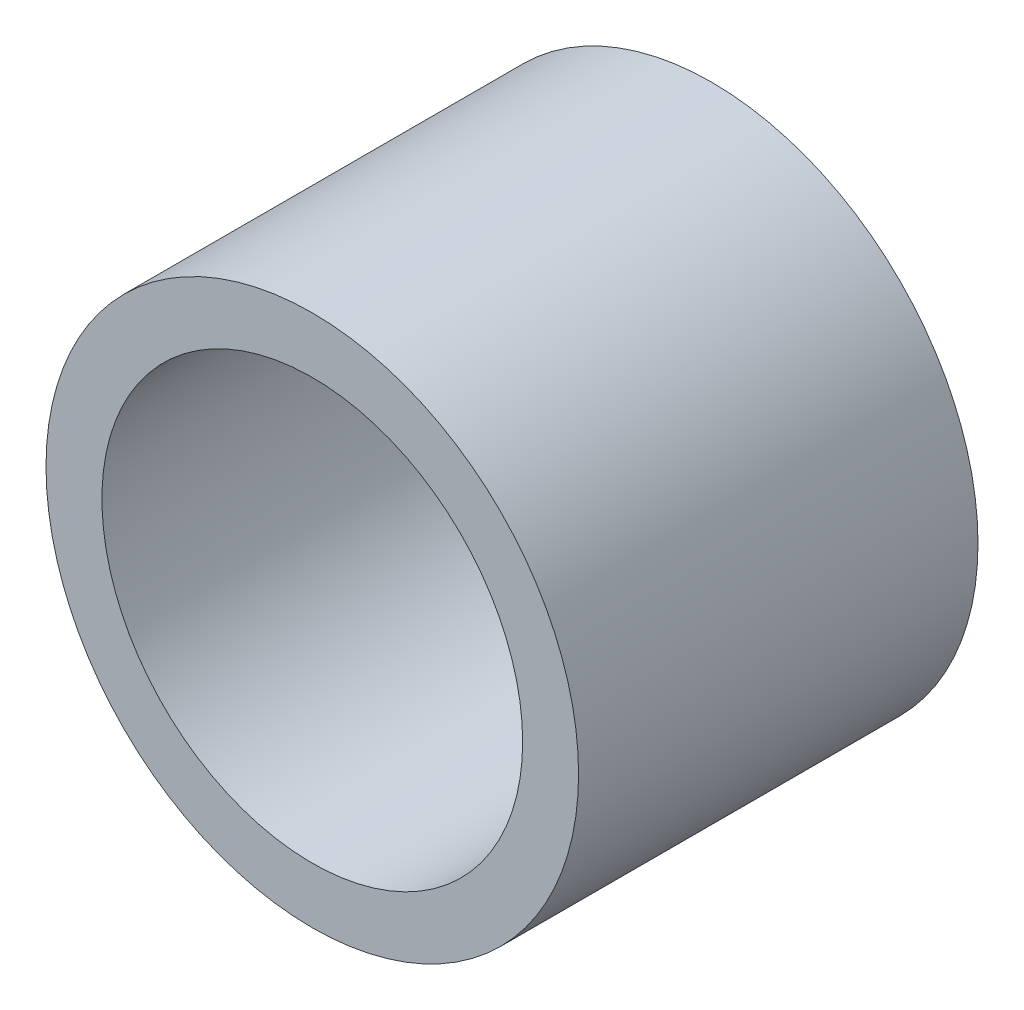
ISO-10303-21;
HEADER;
FILE_DESCRIPTION(('STEP AP214'),'2;1');
FILE_NAME('part.step','',(''),(''),'','','');
FILE_SCHEMA(('AUTOMOTIVE_DESIGN { 1 0 10303 214 1 1 1 1 }'));
ENDSEC;
DATA;
#1=APPLICATION_CONTEXT('core data for automotive mechanical design processes');
#2=APPLICATION_PROTOCOL_DEFINITION('international standard','automotive_design',2000,#1);
#3=PRODUCT_CONTEXT('',#1,'mechanical');
#4=PRODUCT('Part','Part','',(#3));
#5=PRODUCT_RELATED_PRODUCT_CATEGORY('part','',(#4));
#6=PRODUCT_DEFINITION_FORMATION('','',#4);
#7=PRODUCT_DEFINITION_CONTEXT('part definition',#1,'design');
#8=PRODUCT_DEFINITION('design','',#6,#7);
#9=PRODUCT_DEFINITION_SHAPE('','',#8);
#10=(LENGTH_UNIT() NAMED_UNIT(*) SI_UNIT(.MILLI.,.METRE.));
#11=(NAMED_UNIT(*) PLANE_ANGLE_UNIT() SI_UNIT($,.RADIAN.));
#12=(NAMED_UNIT(*) SI_UNIT($,.STERADIAN.) SOLID_ANGLE_UNIT());
#13=UNCERTAINTY_MEASURE_WITH_UNIT(LENGTH_MEASURE(1.E-05),#10,'distance_accuracy_value','');
#14=(GEOMETRIC_REPRESENTATION_CONTEXT(3) GLOBAL_UNCERTAINTY_ASSIGNED_CONTEXT((#13)) GLOBAL_UNIT_ASSIGNED_CONTEXT((#10,
#11,#12)) REPRESENTATION_CONTEXT('',''));
#15=CARTESIAN_POINT('',(0.,0.,0.));
#16=DIRECTION('',(0.,0.,1.));
#17=DIRECTION('',(1.,0.,0.));
#18=AXIS2_PLACEMENT_3D('',#15,#16,#17);
#19=CARTESIAN_POINT('',(-7.62,12.7,30.988));
#20=DIRECTION('',(0.,0.,-1.));
#21=DIRECTION('',(-1.,0.,0.));
#22=AXIS2_PLACEMENT_3D('',#19,#20,#21);
#23=CYLINDRICAL_SURFACE('',#22,2.413);
#24=CARTESIAN_POINT('',(-7.62,12.7,7.112));
#25=DIRECTION('',(0.,0.,1.));
#26=DIRECTION('',(1.,0.,0.));
#27=AXIS2_PLACEMENT_3D('',#24,#25,#26);
#28=CIRCLE('',#27,2.413);
#29=CARTESIAN_POINT('',(-5.207,12.7,7.112));
#30=VERTEX_POINT('',#29);
#31=EDGE_CURVE('E41',#30,#30,#28,.T.);
#32=ORIENTED_EDGE('',*,*,#31,.T.);
#33=EDGE_LOOP('',(#32));
#34=FACE_BOUND('',#33,.T.);
#35=CARTESIAN_POINT('',(-7.62,12.7,1.524));
#36=DIRECTION('',(0.,0.,-1.));
#37=DIRECTION('',(-1.,0.,0.));
#38=AXIS2_PLACEMENT_3D('',#35,#36,#37);
#39=CIRCLE('',#38,2.413);
#40=CARTESIAN_POINT('',(-10.033,12.7,1.524));
#41=VERTEX_POINT('',#40);
#42=EDGE_CURVE('E47',#41,#41,#39,.F.);
#43=ORIENTED_EDGE('',*,*,#42,.F.);
#44=EDGE_LOOP('',(#43));
#45=FACE_BOUND('',#44,.T.);
#46=ADVANCED_FACE('F24',(#34,#45),#23,.F.);
#47=CARTESIAN_POINT('',(0.,0.,38.1));
#48=DIRECTION('',(0.,0.,-1.));
#49=DIRECTION('',(-1.,0.,0.));
#50=AXIS2_PLACEMENT_3D('',#47,#48,#49);
#51=CYLINDRICAL_SURFACE('',#50,25.4);
#52=CARTESIAN_POINT('',(0.,0.,38.1));
#53=DIRECTION('',(0.,0.,1.));
#54=DIRECTION('',(1.,0.,0.));
#55=AXIS2_PLACEMENT_3D('',#52,#53,#54);
#56=CIRCLE('',#55,25.4);
#57=CARTESIAN_POINT('',(-25.4,0.,38.1));
#58=VERTEX_POINT('',#57);
#59=EDGE_CURVE('E10',#58,#58,#56,.T.);
#60=CARTESIAN_POINT('',(0.,0.,0.));
#61=DIRECTION('',(0.,0.,1.));
#62=DIRECTION('',(1.,0.,0.));
#63=AXIS2_PLACEMENT_3D('',#60,#61,#62);
#64=CIRCLE('',#63,25.4);
#65=CARTESIAN_POINT('',(-25.4,0.,0.));
#66=VERTEX_POINT('',#65);
#67=EDGE_CURVE('E32',#66,#66,#64,.T.);
#68=CARTESIAN_POINT('',(-25.4,0.,38.1));
#69=CARTESIAN_POINT('',(-25.4,0.,37.703125));
#70=CARTESIAN_POINT('',(-25.4,0.,37.30625));
#71=CARTESIAN_POINT('',(-25.4,0.,36.5125));
#72=CARTESIAN_POINT('',(-25.4,0.,36.115625));
#73=CARTESIAN_POINT('',(-25.4,0.,35.321875));
#74=CARTESIAN_POINT('',(-25.4,0.,34.925));
#75=CARTESIAN_POINT('',(-25.4,0.,34.13125));
#76=CARTESIAN_POINT('',(-25.4,0.,33.734375));
#77=CARTESIAN_POINT('',(-25.4,0.,32.940625));
#78=CARTESIAN_POINT('',(-25.4,0.,32.54375));
#79=CARTESIAN_POINT('',(-25.4,0.,31.75));
#80=CARTESIAN_POINT('',(-25.4,0.,31.353125));
#81=CARTESIAN_POINT('',(-25.4,0.,30.559375));
#82=CARTESIAN_POINT('',(-25.4,0.,30.1625));
#83=CARTESIAN_POINT('',(-25.4,0.,29.36875));
#84=CARTESIAN_POINT('',(-25.4,0.,28.971875));
#85=CARTESIAN_POINT('',(-25.4,0.,28.178125));
#86=CARTESIAN_POINT('',(-25.4,0.,27.78125));
#87=CARTESIAN_POINT('',(-25.4,0.,26.9875));
#88=CARTESIAN_POINT('',(-25.4,0.,26.590625));
#89=CARTESIAN_POINT('',(-25.4,0.,25.796875));
#90=CARTESIAN_POINT('',(-25.4,0.,25.4));
#91=CARTESIAN_POINT('',(-25.4,0.,24.60625));
#92=CARTESIAN_POINT('',(-25.4,0.,24.209375));
#93=CARTESIAN_POINT('',(-25.4,0.,23.415625));
#94=CARTESIAN_POINT('',(-25.4,0.,23.01875));
#95=CARTESIAN_POINT('',(-25.4,0.,22.225));
#96=CARTESIAN_POINT('',(-25.4,0.,21.828125));
#97=CARTESIAN_POINT('',(-25.4,0.,21.034375));
#98=CARTESIAN_POINT('',(-25.4,0.,20.6375));
#99=CARTESIAN_POINT('',(-25.4,0.,19.84375));
#100=CARTESIAN_POINT('',(-25.4,0.,19.446875));
#101=CARTESIAN_POINT('',(-25.4,0.,18.653125));
#102=CARTESIAN_POINT('',(-25.4,0.,18.25625));
#103=CARTESIAN_POINT('',(-25.4,0.,17.4625));
#104=CARTESIAN_POINT('',(-25.4,0.,17.065625));
#105=CARTESIAN_POINT('',(-25.4,0.,16.271875));
#106=CARTESIAN_POINT('',(-25.4,0.,15.875));
#107=CARTESIAN_POINT('',(-25.4,0.,15.08125));
#108=CARTESIAN_POINT('',(-25.4,0.,14.684375));
#109=CARTESIAN_POINT('',(-25.4,0.,13.890625));
#110=CARTESIAN_POINT('',(-25.4,0.,13.49375));
#111=CARTESIAN_POINT('',(-25.4,0.,12.7));
#112=CARTESIAN_POINT('',(-25.4,0.,12.303125));
#113=CARTESIAN_POINT('',(-25.4,0.,11.509375));
#114=CARTESIAN_POINT('',(-25.4,0.,11.1125));
#115=CARTESIAN_POINT('',(-25.4,0.,10.31875));
#116=CARTESIAN_POINT('',(-25.4,0.,9.921875));
#117=CARTESIAN_POINT('',(-25.4,0.,9.128125));
#118=CARTESIAN_POINT('',(-25.4,0.,8.73125));
#119=CARTESIAN_POINT('',(-25.4,0.,7.9375));
#120=CARTESIAN_POINT('',(-25.4,0.,7.540625));
#121=CARTESIAN_POINT('',(-25.4,0.,6.746875));
#122=CARTESIAN_POINT('',(-25.4,0.,6.35));
#123=CARTESIAN_POINT('',(-25.4,0.,5.55625));
#124=CARTESIAN_POINT('',(-25.4,0.,5.159375));
#125=CARTESIAN_POINT('',(-25.4,0.,4.365625));
#126=CARTESIAN_POINT('',(-25.4,0.,3.96875));
#127=CARTESIAN_POINT('',(-25.4,0.,3.175));
#128=CARTESIAN_POINT('',(-25.4,0.,2.778125));
#129=CARTESIAN_POINT('',(-25.4,0.,1.984375));
#130=CARTESIAN_POINT('',(-25.4,0.,1.5875));
#131=CARTESIAN_POINT('',(-25.4,0.,0.79375));
#132=CARTESIAN_POINT('',(-25.4,0.,0.396875));
#133=CARTESIAN_POINT('',(-25.4,0.,0.));
#134=B_SPLINE_CURVE_WITH_KNOTS('',3,(#68,#69,#70,#71,#72,#73,#74,#75,#76,#77,#78,#79,#80,#81,
#82,#83,#84,#85,#86,#87,#88,#89,#90,#91,#92,#93,#94,#95,#96,#97,#98,#99,#100,#101,#102,#103,
#104,#105,#106,#107,#108,#109,#110,#111,#112,#113,#114,#115,#116,#117,#118,#119,#120,#121,#122,
#123,#124,#125,#126,#127,#128,#129,#130,#131,#132,#133),.UNSPECIFIED.,.F.,.F.,(4,2,2,2,2,2,2,2,
2,2,2,2,2,2,2,2,2,2,2,2,2,2,2,2,2,2,2,2,2,2,2,2,4),(0.,1.19062499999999,2.38124999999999,
3.571875,4.7625,5.953125,7.14375,8.33437499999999,9.525,10.715625,11.90625,13.096875,14.2875,
15.478125,16.66875,17.859375,19.05,20.240625,21.43125,22.621875,23.8125,25.003125,26.19375,
27.384375,28.575,29.765625,30.95625,32.146875,33.3375,34.528125,35.71875,36.909375,38.1),.UNSPECIFIED.);
#135=EDGE_CURVE('BSEAM26',#58,#66,#134,.T.);
#136=ORIENTED_EDGE('',*,*,#59,.F.);
#137=ORIENTED_EDGE('',*,*,#67,.T.);
#138=ORIENTED_EDGE('',*,*,#135,.T.);
#139=ORIENTED_EDGE('',*,*,#135,.F.);
#140=EDGE_LOOP('',(#136,#138,#137,#139));
#141=FACE_BOUND('',#140,.T.);
#142=ADVANCED_FACE('F26',(#141),#51,.T.);
#143=CARTESIAN_POINT('',(0.,0.,38.1));
#144=DIRECTION('',(0.,0.,1.));
#145=DIRECTION('',(1.,0.,0.));
#146=AXIS2_PLACEMENT_3D('',#143,#144,#145);
#147=PLANE('',#146);
#148=CARTESIAN_POINT('',(0.,0.,38.1));
#149=DIRECTION('',(0.,0.,1.));
#150=DIRECTION('',(1.,0.,0.));
#151=AXIS2_PLACEMENT_3D('',#148,#149,#150);
#152=CIRCLE('',#151,20.066);
#153=CARTESIAN_POINT('',(20.066,0.,38.1));
#154=VERTEX_POINT('',#153);
#155=EDGE_CURVE('E44',#154,#154,#152,.T.);
#156=ORIENTED_EDGE('',*,*,#155,.F.);
#157=EDGE_LOOP('',(#156));
#158=FACE_BOUND('',#157,.T.);
#159=ORIENTED_EDGE('',*,*,#59,.T.);
#160=EDGE_LOOP('',(#159));
#161=FACE_BOUND('',#160,.T.);
#162=ADVANCED_FACE('F74',(#158,#161),#147,.T.);
#163=CARTESIAN_POINT('',(0.,0.,0.));
#164=DIRECTION('',(0.,0.,1.));
#165=DIRECTION('',(1.,0.,0.));
#166=AXIS2_PLACEMENT_3D('',#163,#164,#165);
#167=PLANE('',#166);
#168=CARTESIAN_POINT('',(-7.62,-12.7,0.));
#169=DIRECTION('',(0.,0.,-1.));
#170=DIRECTION('',(1.,0.,0.));
#171=AXIS2_PLACEMENT_3D('',#168,#169,#170);
#172=CIRCLE('',#171,4.064);
#173=CARTESIAN_POINT('',(-11.684,-12.7,0.));
#174=VERTEX_POINT('',#173);
#175=EDGE_CURVE('E114',#174,#174,#172,.T.);
#176=ORIENTED_EDGE('',*,*,#175,.F.);
#177=EDGE_LOOP('',(#176));
#178=FACE_BOUND('',#177,.T.);
#179=CARTESIAN_POINT('',(-7.62,12.7,0.));
#180=DIRECTION('',(0.,0.,-1.));
#181=DIRECTION('',(-1.,0.,0.));
#182=AXIS2_PLACEMENT_3D('',#179,#180,#181);
#183=CIRCLE('',#182,4.064);
#184=CARTESIAN_POINT('',(-11.684,12.7,0.));
#185=VERTEX_POINT('',#184);
#186=EDGE_CURVE('E53',#185,#185,#183,.T.);
#187=ORIENTED_EDGE('',*,*,#186,.F.);
#188=EDGE_LOOP('',(#187));
#189=FACE_BOUND('',#188,.T.);
#190=ORIENTED_EDGE('',*,*,#67,.F.);
#191=EDGE_LOOP('',(#190));
#192=FACE_BOUND('',#191,.T.);
#193=ADVANCED_FACE('F70',(#178,#189,#192),#167,.F.);
#194=CARTESIAN_POINT('',(0.,0.,7.112));
#195=DIRECTION('',(0.,0.,1.));
#196=DIRECTION('',(1.,0.,0.));
#197=AXIS2_PLACEMENT_3D('',#194,#195,#196);
#198=CYLINDRICAL_SURFACE('',#197,20.066);
#199=CARTESIAN_POINT('',(0.,0.,7.112));
#200=DIRECTION('',(0.,0.,1.));
#201=DIRECTION('',(1.,0.,0.));
#202=AXIS2_PLACEMENT_3D('',#199,#200,#201);
#203=CIRCLE('',#202,20.066);
#204=CARTESIAN_POINT('',(20.066,0.,7.112));
#205=VERTEX_POINT('',#204);
#206=EDGE_CURVE('E37',#205,#205,#203,.T.);
#207=ORIENTED_EDGE('',*,*,#206,.F.);
#208=EDGE_LOOP('',(#207));
#209=FACE_BOUND('',#208,.T.);
#210=ORIENTED_EDGE('',*,*,#155,.T.);
#211=EDGE_LOOP('',(#210));
#212=FACE_BOUND('',#211,.T.);
#213=ADVANCED_FACE('F67',(#209,#212),#198,.F.);
#214=CARTESIAN_POINT('',(0.,0.,7.112));
#215=DIRECTION('',(0.,0.,1.));
#216=DIRECTION('',(1.,0.,0.));
#217=AXIS2_PLACEMENT_3D('',#214,#215,#216);
#218=PLANE('',#217);
#219=CARTESIAN_POINT('',(-7.62,-12.7,7.112));
#220=DIRECTION('',(0.,0.,1.));
#221=DIRECTION('',(1.,0.,0.));
#222=AXIS2_PLACEMENT_3D('',#219,#220,#221);
#223=CIRCLE('',#222,2.413);
#224=CARTESIAN_POINT('',(-5.207,-12.7,7.112));
#225=VERTEX_POINT('',#224);
#226=EDGE_CURVE('E45',#225,#225,#223,.T.);
#227=ORIENTED_EDGE('',*,*,#226,.F.);
#228=EDGE_LOOP('',(#227));
#229=FACE_BOUND('',#228,.T.);
#230=ORIENTED_EDGE('',*,*,#31,.F.);
#231=EDGE_LOOP('',(#230));
#232=FACE_BOUND('',#231,.T.);
#233=ORIENTED_EDGE('',*,*,#206,.T.);
#234=EDGE_LOOP('',(#233));
#235=FACE_BOUND('',#234,.T.);
#236=ADVANCED_FACE('F65',(#229,#232,#235),#218,.T.);
#237=CARTESIAN_POINT('',(-7.62,-12.7,30.988));
#238=DIRECTION('',(0.,0.,-1.));
#239=DIRECTION('',(-1.,0.,0.));
#240=AXIS2_PLACEMENT_3D('',#237,#238,#239);
#241=CYLINDRICAL_SURFACE('',#240,2.413);
#242=CARTESIAN_POINT('',(-7.62,-12.7,1.524));
#243=DIRECTION('',(0.,0.,1.));
#244=DIRECTION('',(1.,0.,0.));
#245=AXIS2_PLACEMENT_3D('',#242,#243,#244);
#246=CIRCLE('',#245,2.413);
#247=CARTESIAN_POINT('',(-5.207,-12.7,1.524));
#248=VERTEX_POINT('',#247);
#249=EDGE_CURVE('E28',#248,#248,#246,.F.);
#250=ORIENTED_EDGE('',*,*,#249,.T.);
#251=EDGE_LOOP('',(#250));
#252=FACE_BOUND('',#251,.T.);
#253=ORIENTED_EDGE('',*,*,#226,.T.);
#254=EDGE_LOOP('',(#253));
#255=FACE_BOUND('',#254,.T.);
#256=ADVANCED_FACE('F92',(#252,#255),#241,.F.);
#257=CARTESIAN_POINT('',(-7.62,12.7,1.524));
#258=DIRECTION('',(0.,0.,-1.));
#259=DIRECTION('',(-1.,0.,0.));
#260=AXIS2_PLACEMENT_3D('',#257,#258,#259);
#261=PLANE('',#260);
#262=CARTESIAN_POINT('',(-7.62,12.7,1.524));
#263=DIRECTION('',(0.,0.,-1.));
#264=DIRECTION('',(-1.,0.,0.));
#265=AXIS2_PLACEMENT_3D('',#262,#263,#264);
#266=CIRCLE('',#265,4.064);
#267=CARTESIAN_POINT('',(-11.684,12.7,1.524));
#268=VERTEX_POINT('',#267);
#269=EDGE_CURVE('E49',#268,#268,#266,.T.);
#270=ORIENTED_EDGE('',*,*,#269,.T.);
#271=EDGE_LOOP('',(#270));
#272=FACE_BOUND('',#271,.T.);
#273=ORIENTED_EDGE('',*,*,#42,.T.);
#274=EDGE_LOOP('',(#273));
#275=FACE_BOUND('',#274,.T.);
#276=ADVANCED_FACE('F98',(#272,#275),#261,.T.);
#277=CARTESIAN_POINT('',(-7.62,12.7,1.524));
#278=DIRECTION('',(0.,0.,-1.));
#279=DIRECTION('',(-1.,0.,0.));
#280=AXIS2_PLACEMENT_3D('',#277,#278,#279);
#281=CYLINDRICAL_SURFACE('',#280,4.064);
#282=CARTESIAN_POINT('',(-11.684,12.7,1.524));
#283=CARTESIAN_POINT('',(-11.684,12.7,1.508125));
#284=CARTESIAN_POINT('',(-11.684,12.7,1.49225));
#285=CARTESIAN_POINT('',(-11.684,12.7,1.4605));
#286=CARTESIAN_POINT('',(-11.684,12.7,1.444625));
#287=CARTESIAN_POINT('',(-11.684,12.7,1.412875));
#288=CARTESIAN_POINT('',(-11.684,12.7,1.397));
#289=CARTESIAN_POINT('',(-11.684,12.7,1.36525));
#290=CARTESIAN_POINT('',(-11.684,12.7,1.349375));
#291=CARTESIAN_POINT('',(-11.684,12.7,1.317625));
#292=CARTESIAN_POINT('',(-11.684,12.7,1.30175));
#293=CARTESIAN_POINT('',(-11.684,12.7,1.27));
#294=CARTESIAN_POINT('',(-11.684,12.7,1.254125));
#295=CARTESIAN_POINT('',(-11.684,12.7,1.222375));
#296=CARTESIAN_POINT('',(-11.684,12.7,1.2065));
#297=CARTESIAN_POINT('',(-11.684,12.7,1.17475));
#298=CARTESIAN_POINT('',(-11.684,12.7,1.158875));
#299=CARTESIAN_POINT('',(-11.684,12.7,1.127125));
#300=CARTESIAN_POINT('',(-11.684,12.7,1.11125));
#301=CARTESIAN_POINT('',(-11.684,12.7,1.0795));
#302=CARTESIAN_POINT('',(-11.684,12.7,1.063625));
#303=CARTESIAN_POINT('',(-11.684,12.7,1.031875));
#304=CARTESIAN_POINT('',(-11.684,12.7,1.016));
#305=CARTESIAN_POINT('',(-11.684,12.7,0.98425));
#306=CARTESIAN_POINT('',(-11.684,12.7,0.968375));
#307=CARTESIAN_POINT('',(-11.684,12.7,0.936625));
#308=CARTESIAN_POINT('',(-11.684,12.7,0.92075));
#309=CARTESIAN_POINT('',(-11.684,12.7,0.889));
#310=CARTESIAN_POINT('',(-11.684,12.7,0.873125));
#311=CARTESIAN_POINT('',(-11.684,12.7,0.841375));
#312=CARTESIAN_POINT('',(-11.684,12.7,0.8255));
#313=CARTESIAN_POINT('',(-11.684,12.7,0.79375));
#314=CARTESIAN_POINT('',(-11.684,12.7,0.777875));
#315=CARTESIAN_POINT('',(-11.684,12.7,0.746125));
#316=CARTESIAN_POINT('',(-11.684,12.7,0.73025));
#317=CARTESIAN_POINT('',(-11.684,12.7,0.6985));
#318=CARTESIAN_POINT('',(-11.684,12.7,0.682625));
#319=CARTESIAN_POINT('',(-11.684,12.7,0.650875));
#320=CARTESIAN_POINT('',(-11.684,12.7,0.635));
#321=CARTESIAN_POINT('',(-11.684,12.7,0.60325));
#322=CARTESIAN_POINT('',(-11.684,12.7,0.587375));
#323=CARTESIAN_POINT('',(-11.684,12.7,0.555625));
#324=CARTESIAN_POINT('',(-11.684,12.7,0.53975));
#325=CARTESIAN_POINT('',(-11.684,12.7,0.508));
#326=CARTESIAN_POINT('',(-11.684,12.7,0.492125));
#327=CARTESIAN_POINT('',(-11.684,12.7,0.460375));
#328=CARTESIAN_POINT('',(-11.684,12.7,0.4445));
#329=CARTESIAN_POINT('',(-11.684,12.7,0.41275));
#330=CARTESIAN_POINT('',(-11.684,12.7,0.396875));
#331=CARTESIAN_POINT('',(-11.684,12.7,0.365125));
#332=CARTESIAN_POINT('',(-11.684,12.7,0.34925));
#333=CARTESIAN_POINT('',(-11.684,12.7,0.3175));
#334=CARTESIAN_POINT('',(-11.684,12.7,0.301625));
#335=CARTESIAN_POINT('',(-11.684,12.7,0.269875));
#336=CARTESIAN_POINT('',(-11.684,12.7,0.254));
#337=CARTESIAN_POINT('',(-11.684,12.7,0.22225));
#338=CARTESIAN_POINT('',(-11.684,12.7,0.206375));
#339=CARTESIAN_POINT('',(-11.684,12.7,0.174625));
#340=CARTESIAN_POINT('',(-11.684,12.7,0.15875));
#341=CARTESIAN_POINT('',(-11.684,12.7,0.127));
#342=CARTESIAN_POINT('',(-11.684,12.7,0.111125));
#343=CARTESIAN_POINT('',(-11.684,12.7,0.079375));
#344=CARTESIAN_POINT('',(-11.684,12.7,0.0635));
#345=CARTESIAN_POINT('',(-11.684,12.7,0.0317499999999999));
#346=CARTESIAN_POINT('',(-11.684,12.7,0.015875));
#347=CARTESIAN_POINT('',(-11.684,12.7,0.));
#348=B_SPLINE_CURVE_WITH_KNOTS('',3,(#282,#283,#284,#285,#286,#287,#288,#289,#290,#291,#292,
#293,#294,#295,#296,#297,#298,#299,#300,#301,#302,#303,#304,#305,#306,#307,#308,#309,#310,#311,
#312,#313,#314,#315,#316,#317,#318,#319,#320,#321,#322,#323,#324,#325,#326,#327,#328,#329,#330,
#331,#332,#333,#334,#335,#336,#337,#338,#339,#340,#341,#342,#343,#344,#345,#346,#347),
.UNSPECIFIED.,.F.,.F.,(4,2,2,2,2,2,2,2,2,2,2,2,2,2,2,2,2,2,2,2,2,2,2,2,2,2,2,2,2,2,2,2,4),(0.,
0.0476249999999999,0.0952499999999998,0.142875,0.1905,0.238125,0.28575,0.333375,0.381,0.428625,
0.47625,0.523875,0.5715,0.619125,0.66675,0.714375,0.762,0.809625,0.85725,0.904875,0.9525,
1.000125,1.04775,1.095375,1.143,1.190625,1.23825,1.285875,1.3335,1.381125,1.42875,1.476375,
1.524),.UNSPECIFIED.);
#349=EDGE_CURVE('BSEAM107',#268,#185,#348,.T.);
#350=ORIENTED_EDGE('',*,*,#269,.F.);
#351=ORIENTED_EDGE('',*,*,#186,.T.);
#352=ORIENTED_EDGE('',*,*,#349,.T.);
#353=ORIENTED_EDGE('',*,*,#349,.F.);
#354=EDGE_LOOP('',(#350,#352,#351,#353));
#355=FACE_BOUND('',#354,.T.);
#356=ADVANCED_FACE('F107',(#355),#281,.F.);
#357=CARTESIAN_POINT('',(-7.62,-12.7,1.524));
#358=DIRECTION('',(0.,0.,1.));
#359=DIRECTION('',(1.,0.,0.));
#360=AXIS2_PLACEMENT_3D('',#357,#358,#359);
#361=PLANE('',#360);
#362=CARTESIAN_POINT('',(-7.62,-12.7,1.524));
#363=DIRECTION('',(0.,0.,-1.));
#364=DIRECTION('',(1.,0.,0.));
#365=AXIS2_PLACEMENT_3D('',#362,#363,#364);
#366=CIRCLE('',#365,4.064);
#367=CARTESIAN_POINT('',(-11.684,-12.7,1.524));
#368=VERTEX_POINT('',#367);
#369=EDGE_CURVE('E112',#368,#368,#366,.T.);
#370=ORIENTED_EDGE('',*,*,#369,.T.);
#371=EDGE_LOOP('',(#370));
#372=FACE_BOUND('',#371,.T.);
#373=ORIENTED_EDGE('',*,*,#249,.F.);
#374=EDGE_LOOP('',(#373));
#375=FACE_BOUND('',#374,.T.);
#376=ADVANCED_FACE('F129',(#372,#375),#361,.F.);
#377=CARTESIAN_POINT('',(-7.62,-12.7,1.524));
#378=DIRECTION('',(0.,0.,-1.));
#379=DIRECTION('',(-1.,0.,0.));
#380=AXIS2_PLACEMENT_3D('',#377,#378,#379);
#381=CYLINDRICAL_SURFACE('',#380,4.064);
#382=CARTESIAN_POINT('',(-11.684,-12.7,1.524));
#383=CARTESIAN_POINT('',(-11.684,-12.7,1.508125));
#384=CARTESIAN_POINT('',(-11.684,-12.7,1.49225));
#385=CARTESIAN_POINT('',(-11.684,-12.7,1.4605));
#386=CARTESIAN_POINT('',(-11.684,-12.7,1.444625));
#387=CARTESIAN_POINT('',(-11.684,-12.7,1.412875));
#388=CARTESIAN_POINT('',(-11.684,-12.7,1.397));
#389=CARTESIAN_POINT('',(-11.684,-12.7,1.36525));
#390=CARTESIAN_POINT('',(-11.684,-12.7,1.349375));
#391=CARTESIAN_POINT('',(-11.684,-12.7,1.317625));
#392=CARTESIAN_POINT('',(-11.684,-12.7,1.30175));
#393=CARTESIAN_POINT('',(-11.684,-12.7,1.27));
#394=CARTESIAN_POINT('',(-11.684,-12.7,1.254125));
#395=CARTESIAN_POINT('',(-11.684,-12.7,1.222375));
#396=CARTESIAN_POINT('',(-11.684,-12.7,1.2065));
#397=CARTESIAN_POINT('',(-11.684,-12.7,1.17475));
#398=CARTESIAN_POINT('',(-11.684,-12.7,1.158875));
#399=CARTESIAN_POINT('',(-11.684,-12.7,1.127125));
#400=CARTESIAN_POINT('',(-11.684,-12.7,1.11125));
#401=CARTESIAN_POINT('',(-11.684,-12.7,1.0795));
#402=CARTESIAN_POINT('',(-11.684,-12.7,1.063625));
#403=CARTESIAN_POINT('',(-11.684,-12.7,1.031875));
#404=CARTESIAN_POINT('',(-11.684,-12.7,1.016));
#405=CARTESIAN_POINT('',(-11.684,-12.7,0.98425));
#406=CARTESIAN_POINT('',(-11.684,-12.7,0.968375));
#407=CARTESIAN_POINT('',(-11.684,-12.7,0.936625));
#408=CARTESIAN_POINT('',(-11.684,-12.7,0.92075));
#409=CARTESIAN_POINT('',(-11.684,-12.7,0.889));
#410=CARTESIAN_POINT('',(-11.684,-12.7,0.873125));
#411=CARTESIAN_POINT('',(-11.684,-12.7,0.841375));
#412=CARTESIAN_POINT('',(-11.684,-12.7,0.8255));
#413=CARTESIAN_POINT('',(-11.684,-12.7,0.79375));
#414=CARTESIAN_POINT('',(-11.684,-12.7,0.777875));
#415=CARTESIAN_POINT('',(-11.684,-12.7,0.746125));
#416=CARTESIAN_POINT('',(-11.684,-12.7,0.73025));
#417=CARTESIAN_POINT('',(-11.684,-12.7,0.6985));
#418=CARTESIAN_POINT('',(-11.684,-12.7,0.682625));
#419=CARTESIAN_POINT('',(-11.684,-12.7,0.650875));
#420=CARTESIAN_POINT('',(-11.684,-12.7,0.635));
#421=CARTESIAN_POINT('',(-11.684,-12.7,0.60325));
#422=CARTESIAN_POINT('',(-11.684,-12.7,0.587375));
#423=CARTESIAN_POINT('',(-11.684,-12.7,0.555625));
#424=CARTESIAN_POINT('',(-11.684,-12.7,0.53975));
#425=CARTESIAN_POINT('',(-11.684,-12.7,0.508));
#426=CARTESIAN_POINT('',(-11.684,-12.7,0.492125));
#427=CARTESIAN_POINT('',(-11.684,-12.7,0.460375));
#428=CARTESIAN_POINT('',(-11.684,-12.7,0.4445));
#429=CARTESIAN_POINT('',(-11.684,-12.7,0.41275));
#430=CARTESIAN_POINT('',(-11.684,-12.7,0.396875));
#431=CARTESIAN_POINT('',(-11.684,-12.7,0.365125));
#432=CARTESIAN_POINT('',(-11.684,-12.7,0.34925));
#433=CARTESIAN_POINT('',(-11.684,-12.7,0.3175));
#434=CARTESIAN_POINT('',(-11.684,-12.7,0.301625));
#435=CARTESIAN_POINT('',(-11.684,-12.7,0.269875));
#436=CARTESIAN_POINT('',(-11.684,-12.7,0.254));
#437=CARTESIAN_POINT('',(-11.684,-12.7,0.22225));
#438=CARTESIAN_POINT('',(-11.684,-12.7,0.206375));
#439=CARTESIAN_POINT('',(-11.684,-12.7,0.174625));
#440=CARTESIAN_POINT('',(-11.684,-12.7,0.15875));
#441=CARTESIAN_POINT('',(-11.684,-12.7,0.127));
#442=CARTESIAN_POINT('',(-11.684,-12.7,0.111125));
#443=CARTESIAN_POINT('',(-11.684,-12.7,0.079375));
#444=CARTESIAN_POINT('',(-11.684,-12.7,0.0635));
#445=CARTESIAN_POINT('',(-11.684,-12.7,0.0317499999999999));
#446=CARTESIAN_POINT('',(-11.684,-12.7,0.015875));
#447=CARTESIAN_POINT('',(-11.684,-12.7,0.));
#448=B_SPLINE_CURVE_WITH_KNOTS('',3,(#382,#383,#384,#385,#386,#387,#388,#389,#390,#391,#392,
#393,#394,#395,#396,#397,#398,#399,#400,#401,#402,#403,#404,#405,#406,#407,#408,#409,#410,#411,
#412,#413,#414,#415,#416,#417,#418,#419,#420,#421,#422,#423,#424,#425,#426,#427,#428,#429,#430,
#431,#432,#433,#434,#435,#436,#437,#438,#439,#440,#441,#442,#443,#444,#445,#446,#447),
.UNSPECIFIED.,.F.,.F.,(4,2,2,2,2,2,2,2,2,2,2,2,2,2,2,2,2,2,2,2,2,2,2,2,2,2,2,2,2,2,2,2,4),(0.,
0.0476249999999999,0.0952499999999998,0.142875,0.1905,0.238125,0.28575,0.333375,0.381,0.428625,
0.47625,0.523875,0.5715,0.619125,0.66675,0.714375,0.762,0.809625,0.85725,0.904875,0.9525,
1.000125,1.04775,1.095375,1.143,1.190625,1.23825,1.285875,1.3335,1.381125,1.42875,1.476375,
1.524),.UNSPECIFIED.);
#449=EDGE_CURVE('BSEAM121',#368,#174,#448,.T.);
#450=ORIENTED_EDGE('',*,*,#369,.F.);
#451=ORIENTED_EDGE('',*,*,#175,.T.);
#452=ORIENTED_EDGE('',*,*,#449,.T.);
#453=ORIENTED_EDGE('',*,*,#449,.F.);
#454=EDGE_LOOP('',(#450,#452,#451,#453));
#455=FACE_BOUND('',#454,.T.);
#456=ADVANCED_FACE('F121',(#455),#381,.F.);
#457=CLOSED_SHELL('',(#46,#142,#162,#193,#213,#236,#256,#276,#356,#376,#456));
#458=MANIFOLD_SOLID_BREP('B2',#457);
#459=ADVANCED_BREP_SHAPE_REPRESENTATION('',(#18,#458),#14);
#460=SHAPE_DEFINITION_REPRESENTATION(#9,#459);
ENDSEC;
END-ISO-10303-21;
